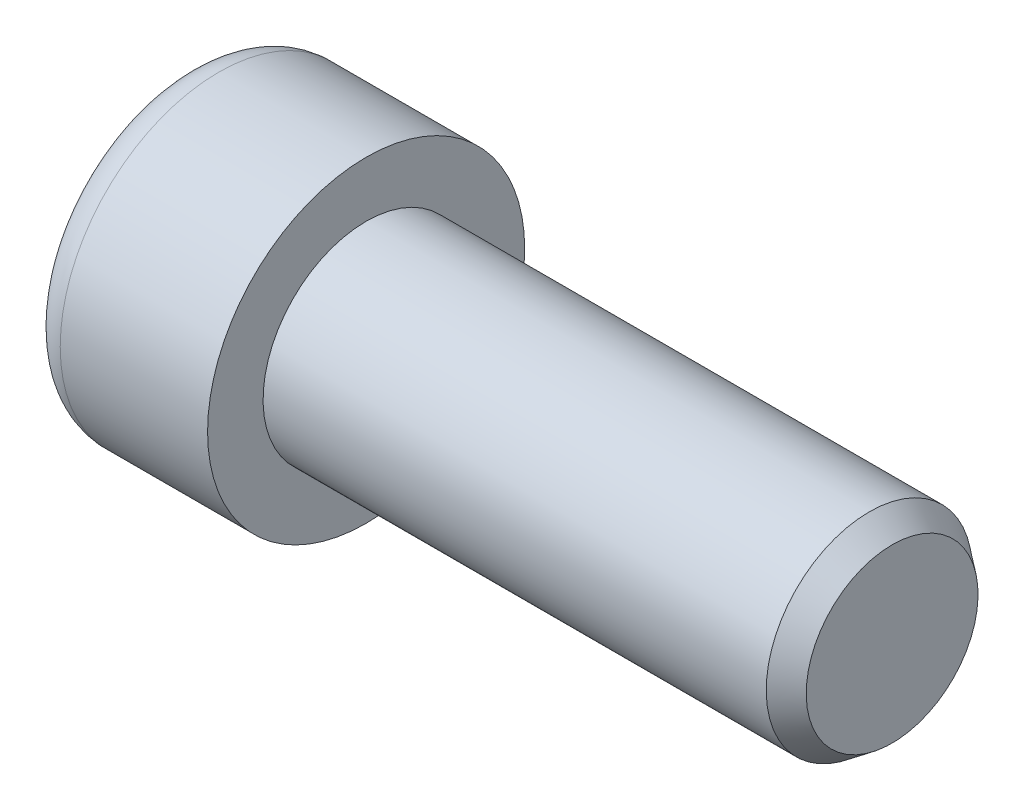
ISO-10303-21;
HEADER;
FILE_DESCRIPTION(('STEP AP214'),'2;1');
FILE_NAME('part.step','',(''),(''),'','','');
FILE_SCHEMA(('AUTOMOTIVE_DESIGN { 1 0 10303 214 1 1 1 1 }'));
ENDSEC;
DATA;
#1=APPLICATION_CONTEXT('core data for automotive mechanical design processes');
#2=APPLICATION_PROTOCOL_DEFINITION('international standard','automotive_design',2000,#1);
#3=PRODUCT_CONTEXT('',#1,'mechanical');
#4=PRODUCT('Part','Part','',(#3));
#5=PRODUCT_RELATED_PRODUCT_CATEGORY('part','',(#4));
#6=PRODUCT_DEFINITION_FORMATION('','',#4);
#7=PRODUCT_DEFINITION_CONTEXT('part definition',#1,'design');
#8=PRODUCT_DEFINITION('design','',#6,#7);
#9=PRODUCT_DEFINITION_SHAPE('','',#8);
#10=(LENGTH_UNIT() NAMED_UNIT(*) SI_UNIT(.MILLI.,.METRE.));
#11=(NAMED_UNIT(*) PLANE_ANGLE_UNIT() SI_UNIT($,.RADIAN.));
#12=(NAMED_UNIT(*) SI_UNIT($,.STERADIAN.) SOLID_ANGLE_UNIT());
#13=UNCERTAINTY_MEASURE_WITH_UNIT(LENGTH_MEASURE(1.E-05),#10,'distance_accuracy_value','');
#14=(GEOMETRIC_REPRESENTATION_CONTEXT(3) GLOBAL_UNCERTAINTY_ASSIGNED_CONTEXT((#13)) GLOBAL_UNIT_ASSIGNED_CONTEXT((#10,
#11,#12)) REPRESENTATION_CONTEXT('',''));
#15=CARTESIAN_POINT('',(0.,0.,0.));
#16=DIRECTION('',(0.,0.,1.));
#17=DIRECTION('',(1.,0.,0.));
#18=AXIS2_PLACEMENT_3D('',#15,#16,#17);
#19=CARTESIAN_POINT('',(-260.200583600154,267.378428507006,503.922005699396));
#20=DIRECTION('',(1.,0.,0.));
#21=DIRECTION('',(0.,1.,0.));
#22=AXIS2_PLACEMENT_3D('',#19,#20,#21);
#23=PLANE('',#22);
#24=CARTESIAN_POINT('',(-260.200583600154,267.378428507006,503.922005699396));
#25=DIRECTION('',(1.,0.,0.));
#26=DIRECTION('',(0.,1.,0.));
#27=AXIS2_PLACEMENT_3D('',#24,#25,#26);
#28=CIRCLE('',#27,2.50055726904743);
#29=CARTESIAN_POINT('',(-260.200583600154,269.878985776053,503.922005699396));
#30=VERTEX_POINT('',#29);
#31=EDGE_CURVE('E149',#30,#30,#28,.T.);
#32=ORIENTED_EDGE('',*,*,#31,.T.);
#33=EDGE_LOOP('',(#32));
#34=FACE_BOUND('',#33,.T.);
#35=ADVANCED_FACE('F33',(#34),#23,.T.);
#36=CARTESIAN_POINT('',(-260.200583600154,267.378428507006,503.922005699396));
#37=DIRECTION('',(-1.,0.,0.));
#38=DIRECTION('',(0.,-1.,0.));
#39=AXIS2_PLACEMENT_3D('',#36,#37,#38);
#40=CONICAL_SURFACE('',#39,2.50055726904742,0.644706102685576);
#41=CARTESIAN_POINT('',(-260.864838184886,267.378428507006,503.922005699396));
#42=DIRECTION('',(1.,0.,0.));
#43=DIRECTION('',(0.,1.,0.));
#44=AXIS2_PLACEMENT_3D('',#41,#42,#43);
#45=CIRCLE('',#44,2.99999999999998);
#46=CARTESIAN_POINT('',(-260.864838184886,270.378428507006,503.922005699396));
#47=VERTEX_POINT('',#46);
#48=EDGE_CURVE('E146',#47,#47,#45,.T.);
#49=ORIENTED_EDGE('',*,*,#48,.T.);
#50=EDGE_LOOP('',(#49));
#51=FACE_BOUND('',#50,.T.);
#52=ORIENTED_EDGE('',*,*,#31,.F.);
#53=EDGE_LOOP('',(#52));
#54=FACE_BOUND('',#53,.T.);
#55=ADVANCED_FACE('F166',(#51,#54),#40,.T.);
#56=CARTESIAN_POINT('',(-255.510043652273,267.378428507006,503.922005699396));
#57=DIRECTION('',(1.,0.,0.));
#58=DIRECTION('',(0.,1.,0.));
#59=AXIS2_PLACEMENT_3D('',#56,#57,#58);
#60=CYLINDRICAL_SURFACE('',#59,2.99999999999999);
#61=CARTESIAN_POINT('',(-275.510043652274,267.378428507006,503.922005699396));
#62=DIRECTION('',(1.,0.,0.));
#63=DIRECTION('',(0.,1.,0.));
#64=AXIS2_PLACEMENT_3D('',#61,#62,#63);
#65=CIRCLE('',#64,3.);
#66=CARTESIAN_POINT('',(-275.510043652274,270.378428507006,503.922005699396));
#67=VERTEX_POINT('',#66);
#68=EDGE_CURVE('E143',#67,#67,#65,.T.);
#69=ORIENTED_EDGE('',*,*,#68,.T.);
#70=EDGE_LOOP('',(#69));
#71=FACE_BOUND('',#70,.T.);
#72=ORIENTED_EDGE('',*,*,#48,.F.);
#73=EDGE_LOOP('',(#72));
#74=FACE_BOUND('',#73,.T.);
#75=ADVANCED_FACE('F171',(#71,#74),#60,.T.);
#76=CARTESIAN_POINT('',(-275.510043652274,264.483923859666,504.710575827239));
#77=DIRECTION('',(1.,0.,0.));
#78=DIRECTION('',(0.,1.,0.));
#79=AXIS2_PLACEMENT_3D('',#76,#77,#78);
#80=PLANE('',#79);
#81=CARTESIAN_POINT('',(-275.510043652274,267.378428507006,503.922005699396));
#82=DIRECTION('',(1.,0.,0.));
#83=DIRECTION('',(0.,1.,0.));
#84=AXIS2_PLACEMENT_3D('',#81,#82,#83);
#85=CIRCLE('',#84,4.61506252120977);
#86=CARTESIAN_POINT('',(-275.510043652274,271.993491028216,503.922005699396));
#87=VERTEX_POINT('',#86);
#88=EDGE_CURVE('E135',#87,#87,#85,.T.);
#89=ORIENTED_EDGE('',*,*,#88,.T.);
#90=EDGE_LOOP('',(#89));
#91=FACE_BOUND('',#90,.T.);
#92=ORIENTED_EDGE('',*,*,#68,.F.);
#93=EDGE_LOOP('',(#92));
#94=FACE_BOUND('',#93,.T.);
#95=ADVANCED_FACE('F177',(#91,#94),#80,.T.);
#96=CARTESIAN_POINT('',(-255.510043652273,267.378428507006,503.922005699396));
#97=DIRECTION('',(1.,0.,0.));
#98=DIRECTION('',(0.,1.,0.));
#99=AXIS2_PLACEMENT_3D('',#96,#97,#98);
#100=CYLINDRICAL_SURFACE('',#99,4.61506252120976);
#101=CARTESIAN_POINT('',(-279.798930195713,267.378428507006,503.922005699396));
#102=DIRECTION('',(-1.,0.,0.));
#103=DIRECTION('',(0.,-1.,0.));
#104=AXIS2_PLACEMENT_3D('',#101,#102,#103);
#105=CIRCLE('',#104,4.61506252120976);
#106=CARTESIAN_POINT('',(-279.798930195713,262.763365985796,503.922005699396));
#107=VERTEX_POINT('',#106);
#108=EDGE_CURVE('E41',#107,#107,#105,.F.);
#109=ORIENTED_EDGE('',*,*,#108,.T.);
#110=EDGE_LOOP('',(#109));
#111=FACE_BOUND('',#110,.T.);
#112=ORIENTED_EDGE('',*,*,#88,.F.);
#113=EDGE_LOOP('',(#112));
#114=FACE_BOUND('',#113,.T.);
#115=ADVANCED_FACE('F154',(#111,#114),#100,.T.);
#116=CARTESIAN_POINT('',(-280.798930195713,262.92565520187,505.135105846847));
#117=DIRECTION('',(-1.,0.,0.));
#118=DIRECTION('',(0.,-1.,0.));
#119=AXIS2_PLACEMENT_3D('',#116,#117,#118);
#120=PLANE('',#119);
#121=CARTESIAN_POINT('',(-280.798930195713,267.378428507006,503.922005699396));
#122=DIRECTION('',(-1.,0.,0.));
#123=DIRECTION('',(0.,-1.,0.));
#124=AXIS2_PLACEMENT_3D('',#121,#122,#123);
#125=CIRCLE('',#124,3.61506252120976);
#126=CARTESIAN_POINT('',(-280.798930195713,263.763365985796,503.922005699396));
#127=VERTEX_POINT('',#126);
#128=EDGE_CURVE('E11',#127,#127,#125,.T.);
#129=ORIENTED_EDGE('',*,*,#128,.T.);
#130=EDGE_LOOP('',(#129));
#131=FACE_BOUND('',#130,.T.);
#132=DIRECTION('',(0.,0.96632702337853,0.257317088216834));
#133=VECTOR('',#132,1.);
#134=CARTESIAN_POINT('',(-280.798930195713,265.747975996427,505.557535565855));
#135=LINE('',#134,#133);
#136=CARTESIAN_POINT('',(-280.798930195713,265.747975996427,505.557535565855));
#137=VERTEX_POINT('',#136);
#138=CARTESIAN_POINT('',(-280.798930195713,267.979612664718,506.151783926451));
#139=VERTEX_POINT('',#138);
#140=EDGE_CURVE('E48',#137,#139,#135,.T.);
#141=ORIENTED_EDGE('',*,*,#140,.F.);
#142=DIRECTION('',(0.,0.260320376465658,0.96552229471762));
#143=VECTOR('',#142,1.);
#144=CARTESIAN_POINT('',(-280.798930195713,265.146791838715,503.327757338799));
#145=LINE('',#144,#143);
#146=CARTESIAN_POINT('',(-280.798930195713,265.146791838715,503.327757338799));
#147=VERTEX_POINT('',#146);
#148=EDGE_CURVE('E131',#147,#137,#145,.T.);
#149=ORIENTED_EDGE('',*,*,#148,.F.);
#150=DIRECTION('',(0.,-0.706006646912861,0.708205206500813));
#151=VECTOR('',#150,1.);
#152=CARTESIAN_POINT('',(-280.798930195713,266.777244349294,501.69222747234));
#153=LINE('',#152,#151);
#154=CARTESIAN_POINT('',(-280.798930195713,266.777244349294,501.69222747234));
#155=VERTEX_POINT('',#154);
#156=EDGE_CURVE('E129',#155,#147,#153,.T.);
#157=ORIENTED_EDGE('',*,*,#156,.F.);
#158=DIRECTION('',(0.,-0.966327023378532,-0.257317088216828));
#159=VECTOR('',#158,1.);
#160=CARTESIAN_POINT('',(-280.798930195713,269.008881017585,502.286475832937));
#161=LINE('',#160,#159);
#162=CARTESIAN_POINT('',(-280.798930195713,269.008881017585,502.286475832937));
#163=VERTEX_POINT('',#162);
#164=EDGE_CURVE('E96',#163,#155,#161,.T.);
#165=ORIENTED_EDGE('',*,*,#164,.F.);
#166=DIRECTION('',(0.,-0.260320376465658,-0.96552229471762));
#167=VECTOR('',#166,1.);
#168=CARTESIAN_POINT('',(-280.798930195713,269.610065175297,504.516254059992));
#169=LINE('',#168,#167);
#170=CARTESIAN_POINT('',(-280.798930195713,269.610065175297,504.516254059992));
#171=VERTEX_POINT('',#170);
#172=EDGE_CURVE('E125',#171,#163,#169,.T.);
#173=ORIENTED_EDGE('',*,*,#172,.F.);
#174=DIRECTION('',(0.,0.706006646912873,-0.708205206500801));
#175=VECTOR('',#174,1.);
#176=CARTESIAN_POINT('',(-280.798930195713,267.979612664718,506.151783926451));
#177=LINE('',#176,#175);
#178=EDGE_CURVE('E122',#139,#171,#177,.T.);
#179=ORIENTED_EDGE('',*,*,#178,.F.);
#180=EDGE_LOOP('',(#141,#149,#157,#165,#173,#179));
#181=FACE_BOUND('',#180,.T.);
#182=ADVANCED_FACE('F184',(#131,#181),#120,.T.);
#183=CARTESIAN_POINT('',(-277.798930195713,265.747975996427,505.557535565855));
#184=DIRECTION('',(0.,-0.257317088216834,0.96632702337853));
#185=DIRECTION('',(0.,-0.96632702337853,-0.257317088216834));
#186=AXIS2_PLACEMENT_3D('',#183,#184,#185);
#187=PLANE('',#186);
#188=ORIENTED_EDGE('',*,*,#140,.T.);
#189=DIRECTION('',(-1.,0.,0.));
#190=VECTOR('',#189,1.);
#191=CARTESIAN_POINT('',(-277.798930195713,267.979612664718,506.151783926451));
#192=LINE('',#191,#190);
#193=CARTESIAN_POINT('',(-277.798930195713,267.979612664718,506.151783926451));
#194=VERTEX_POINT('',#193);
#195=EDGE_CURVE('E78',#194,#139,#192,.T.);
#196=ORIENTED_EDGE('',*,*,#195,.F.);
#197=DIRECTION('',(0.,0.96632702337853,0.257317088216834));
#198=VECTOR('',#197,1.);
#199=CARTESIAN_POINT('',(-277.798930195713,265.747975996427,505.557535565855));
#200=LINE('',#199,#198);
#201=CARTESIAN_POINT('',(-277.798930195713,265.747975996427,505.557535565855));
#202=VERTEX_POINT('',#201);
#203=EDGE_CURVE('E133',#202,#194,#200,.T.);
#204=ORIENTED_EDGE('',*,*,#203,.F.);
#205=DIRECTION('',(-1.,0.,0.));
#206=VECTOR('',#205,1.);
#207=CARTESIAN_POINT('',(-277.798930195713,265.747975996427,505.557535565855));
#208=LINE('',#207,#206);
#209=EDGE_CURVE('E56',#202,#137,#208,.T.);
#210=ORIENTED_EDGE('',*,*,#209,.T.);
#211=EDGE_LOOP('',(#188,#196,#204,#210));
#212=FACE_BOUND('',#211,.T.);
#213=ADVANCED_FACE('F187',(#212),#187,.F.);
#214=CARTESIAN_POINT('',(-277.798930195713,265.146791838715,503.327757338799));
#215=DIRECTION('',(0.,-0.96552229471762,0.260320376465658));
#216=DIRECTION('',(0.,-0.260320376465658,-0.96552229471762));
#217=AXIS2_PLACEMENT_3D('',#214,#215,#216);
#218=PLANE('',#217);
#219=ORIENTED_EDGE('',*,*,#148,.T.);
#220=ORIENTED_EDGE('',*,*,#209,.F.);
#221=DIRECTION('',(0.,0.260320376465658,0.96552229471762));
#222=VECTOR('',#221,1.);
#223=CARTESIAN_POINT('',(-277.798930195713,265.146791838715,503.327757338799));
#224=LINE('',#223,#222);
#225=CARTESIAN_POINT('',(-277.798930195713,265.146791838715,503.327757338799));
#226=VERTEX_POINT('',#225);
#227=EDGE_CURVE('E108',#226,#202,#224,.T.);
#228=ORIENTED_EDGE('',*,*,#227,.F.);
#229=DIRECTION('',(-1.,0.,0.));
#230=VECTOR('',#229,1.);
#231=CARTESIAN_POINT('',(-277.798930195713,265.146791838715,503.327757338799));
#232=LINE('',#231,#230);
#233=EDGE_CURVE('E100',#226,#147,#232,.T.);
#234=ORIENTED_EDGE('',*,*,#233,.T.);
#235=EDGE_LOOP('',(#219,#220,#228,#234));
#236=FACE_BOUND('',#235,.T.);
#237=ADVANCED_FACE('F191',(#236),#218,.F.);
#238=CARTESIAN_POINT('',(-277.798930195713,266.777244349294,501.69222747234));
#239=DIRECTION('',(0.,-0.708205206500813,-0.706006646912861));
#240=DIRECTION('',(0.,0.706006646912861,-0.708205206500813));
#241=AXIS2_PLACEMENT_3D('',#238,#239,#240);
#242=PLANE('',#241);
#243=ORIENTED_EDGE('',*,*,#156,.T.);
#244=ORIENTED_EDGE('',*,*,#233,.F.);
#245=DIRECTION('',(0.,-0.706006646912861,0.708205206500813));
#246=VECTOR('',#245,1.);
#247=CARTESIAN_POINT('',(-277.798930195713,266.777244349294,501.69222747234));
#248=LINE('',#247,#246);
#249=CARTESIAN_POINT('',(-277.798930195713,266.777244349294,501.69222747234));
#250=VERTEX_POINT('',#249);
#251=EDGE_CURVE('E104',#250,#226,#248,.T.);
#252=ORIENTED_EDGE('',*,*,#251,.F.);
#253=DIRECTION('',(-1.,0.,0.));
#254=VECTOR('',#253,1.);
#255=CARTESIAN_POINT('',(-277.798930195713,266.777244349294,501.69222747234));
#256=LINE('',#255,#254);
#257=EDGE_CURVE('E89',#250,#155,#256,.T.);
#258=ORIENTED_EDGE('',*,*,#257,.T.);
#259=EDGE_LOOP('',(#243,#244,#252,#258));
#260=FACE_BOUND('',#259,.T.);
#261=ADVANCED_FACE('F105',(#260),#242,.F.);
#262=CARTESIAN_POINT('',(-277.798930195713,269.008881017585,502.286475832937));
#263=DIRECTION('',(0.,0.257317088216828,-0.966327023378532));
#264=DIRECTION('',(0.,0.966327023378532,0.257317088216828));
#265=AXIS2_PLACEMENT_3D('',#262,#263,#264);
#266=PLANE('',#265);
#267=ORIENTED_EDGE('',*,*,#164,.T.);
#268=ORIENTED_EDGE('',*,*,#257,.F.);
#269=DIRECTION('',(0.,-0.966327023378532,-0.257317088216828));
#270=VECTOR('',#269,1.);
#271=CARTESIAN_POINT('',(-277.798930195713,269.008881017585,502.286475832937));
#272=LINE('',#271,#270);
#273=CARTESIAN_POINT('',(-277.798930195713,269.008881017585,502.286475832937));
#274=VERTEX_POINT('',#273);
#275=EDGE_CURVE('E93',#274,#250,#272,.T.);
#276=ORIENTED_EDGE('',*,*,#275,.F.);
#277=DIRECTION('',(-1.,0.,0.));
#278=VECTOR('',#277,1.);
#279=CARTESIAN_POINT('',(-277.798930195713,269.008881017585,502.286475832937));
#280=LINE('',#279,#278);
#281=EDGE_CURVE('E101',#274,#163,#280,.T.);
#282=ORIENTED_EDGE('',*,*,#281,.T.);
#283=EDGE_LOOP('',(#267,#268,#276,#282));
#284=FACE_BOUND('',#283,.T.);
#285=ADVANCED_FACE('F91',(#284),#266,.F.);
#286=CARTESIAN_POINT('',(-277.798930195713,269.610065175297,504.516254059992));
#287=DIRECTION('',(0.,0.96552229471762,-0.260320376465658));
#288=DIRECTION('',(0.,0.260320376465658,0.96552229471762));
#289=AXIS2_PLACEMENT_3D('',#286,#287,#288);
#290=PLANE('',#289);
#291=ORIENTED_EDGE('',*,*,#172,.T.);
#292=ORIENTED_EDGE('',*,*,#281,.F.);
#293=DIRECTION('',(0.,-0.260320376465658,-0.96552229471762));
#294=VECTOR('',#293,1.);
#295=CARTESIAN_POINT('',(-277.798930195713,269.610065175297,504.516254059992));
#296=LINE('',#295,#294);
#297=CARTESIAN_POINT('',(-277.798930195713,269.610065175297,504.516254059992));
#298=VERTEX_POINT('',#297);
#299=EDGE_CURVE('E114',#298,#274,#296,.T.);
#300=ORIENTED_EDGE('',*,*,#299,.F.);
#301=DIRECTION('',(-1.,0.,0.));
#302=VECTOR('',#301,1.);
#303=CARTESIAN_POINT('',(-277.798930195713,269.610065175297,504.516254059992));
#304=LINE('',#303,#302);
#305=EDGE_CURVE('E138',#298,#171,#304,.T.);
#306=ORIENTED_EDGE('',*,*,#305,.T.);
#307=EDGE_LOOP('',(#291,#292,#300,#306));
#308=FACE_BOUND('',#307,.T.);
#309=ADVANCED_FACE('F194',(#308),#290,.F.);
#310=CARTESIAN_POINT('',(-277.798930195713,267.979612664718,506.151783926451));
#311=DIRECTION('',(0.,0.708205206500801,0.706006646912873));
#312=DIRECTION('',(0.,-0.706006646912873,0.708205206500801));
#313=AXIS2_PLACEMENT_3D('',#310,#311,#312);
#314=PLANE('',#313);
#315=ORIENTED_EDGE('',*,*,#178,.T.);
#316=ORIENTED_EDGE('',*,*,#305,.F.);
#317=DIRECTION('',(0.,0.706006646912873,-0.708205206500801));
#318=VECTOR('',#317,1.);
#319=CARTESIAN_POINT('',(-277.798930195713,267.979612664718,506.151783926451));
#320=LINE('',#319,#318);
#321=EDGE_CURVE('E116',#194,#298,#320,.T.);
#322=ORIENTED_EDGE('',*,*,#321,.F.);
#323=ORIENTED_EDGE('',*,*,#195,.T.);
#324=EDGE_LOOP('',(#315,#316,#322,#323));
#325=FACE_BOUND('',#324,.T.);
#326=ADVANCED_FACE('F162',(#325),#314,.F.);
#327=CARTESIAN_POINT('',(-277.798930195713,267.979612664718,506.151783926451));
#328=DIRECTION('',(-1.,0.,0.));
#329=DIRECTION('',(0.,0.,1.));
#330=AXIS2_PLACEMENT_3D('',#327,#328,#329);
#331=PLANE('',#330);
#332=ORIENTED_EDGE('',*,*,#203,.T.);
#333=ORIENTED_EDGE('',*,*,#321,.T.);
#334=ORIENTED_EDGE('',*,*,#299,.T.);
#335=ORIENTED_EDGE('',*,*,#275,.T.);
#336=ORIENTED_EDGE('',*,*,#251,.T.);
#337=ORIENTED_EDGE('',*,*,#227,.T.);
#338=EDGE_LOOP('',(#332,#333,#334,#335,#336,#337));
#339=FACE_BOUND('',#338,.T.);
#340=ADVANCED_FACE('F111',(#339),#331,.T.);
#341=CARTESIAN_POINT('',(-279.798930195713,267.378428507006,503.922005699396));
#342=DIRECTION('',(-1.,0.,0.));
#343=DIRECTION('',(0.,-1.,0.));
#344=AXIS2_PLACEMENT_3D('',#341,#342,#343);
#345=TOROIDAL_SURFACE('',#344,3.61506252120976,1.);
#346=ORIENTED_EDGE('',*,*,#128,.F.);
#347=EDGE_LOOP('',(#346));
#348=FACE_BOUND('',#347,.T.);
#349=ORIENTED_EDGE('',*,*,#108,.F.);
#350=EDGE_LOOP('',(#349));
#351=FACE_BOUND('',#350,.T.);
#352=ADVANCED_FACE('F35',(#348,#351),#345,.T.);
#353=CLOSED_SHELL('',(#35,#55,#75,#95,#115,#182,#213,#237,#261,#285,#309,#326,#340,#352));
#354=MANIFOLD_SOLID_BREP('B2',#353);
#355=ADVANCED_BREP_SHAPE_REPRESENTATION('',(#18,#354),#14);
#356=SHAPE_DEFINITION_REPRESENTATION(#9,#355);
ENDSEC;
END-ISO-10303-21;
